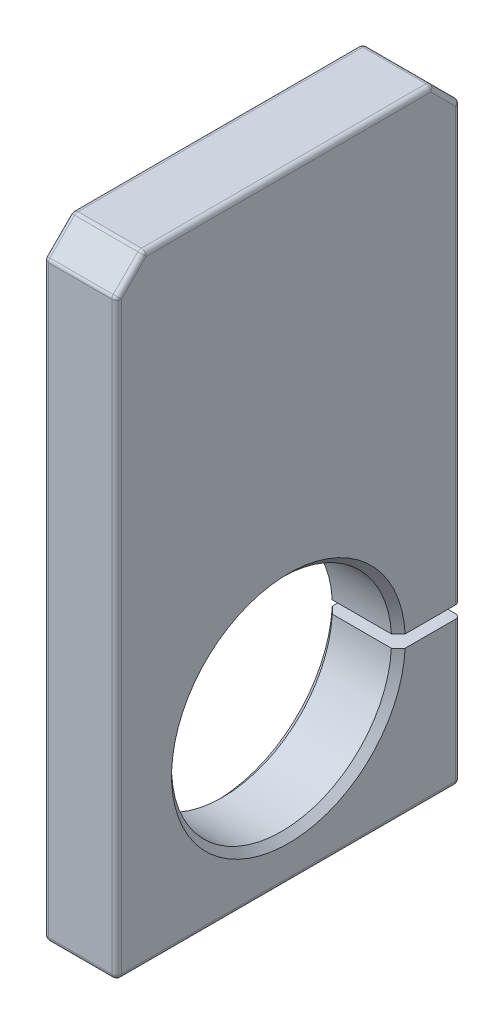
ISO-10303-21;
HEADER;
FILE_DESCRIPTION(('STEP AP214'),'2;1');
FILE_NAME('part.step','',(''),(''),'','','');
FILE_SCHEMA(('AUTOMOTIVE_DESIGN { 1 0 10303 214 1 1 1 1 }'));
ENDSEC;
DATA;
#1=APPLICATION_CONTEXT('core data for automotive mechanical design processes');
#2=APPLICATION_PROTOCOL_DEFINITION('international standard','automotive_design',2000,#1);
#3=PRODUCT_CONTEXT('',#1,'mechanical');
#4=PRODUCT('Part','Part','',(#3));
#5=PRODUCT_RELATED_PRODUCT_CATEGORY('part','',(#4));
#6=PRODUCT_DEFINITION_FORMATION('','',#4);
#7=PRODUCT_DEFINITION_CONTEXT('part definition',#1,'design');
#8=PRODUCT_DEFINITION('design','',#6,#7);
#9=PRODUCT_DEFINITION_SHAPE('','',#8);
#10=(LENGTH_UNIT() NAMED_UNIT(*) SI_UNIT(.MILLI.,.METRE.));
#11=(NAMED_UNIT(*) PLANE_ANGLE_UNIT() SI_UNIT($,.RADIAN.));
#12=(NAMED_UNIT(*) SI_UNIT($,.STERADIAN.) SOLID_ANGLE_UNIT());
#13=UNCERTAINTY_MEASURE_WITH_UNIT(LENGTH_MEASURE(1.E-05),#10,'distance_accuracy_value','');
#14=(GEOMETRIC_REPRESENTATION_CONTEXT(3) GLOBAL_UNCERTAINTY_ASSIGNED_CONTEXT((#13)) GLOBAL_UNIT_ASSIGNED_CONTEXT((#10,
#11,#12)) REPRESENTATION_CONTEXT('',''));
#15=CARTESIAN_POINT('',(0.,0.,0.));
#16=DIRECTION('',(0.,0.,1.));
#17=DIRECTION('',(1.,0.,0.));
#18=AXIS2_PLACEMENT_3D('',#15,#16,#17);
#19=CARTESIAN_POINT('',(-2.65,34.,12.5));
#20=DIRECTION('',(0.,0.,1.));
#21=DIRECTION('',(0.,-1.,0.));
#22=AXIS2_PLACEMENT_3D('',#19,#20,#21);
#23=PLANE('',#22);
#24=DIRECTION('',(0.,-1.,0.));
#25=VECTOR('',#24,1.);
#26=CARTESIAN_POINT('',(2.3,34.,12.5));
#27=LINE('',#26,#25);
#28=CARTESIAN_POINT('',(2.3,-10.65,12.5));
#29=VERTEX_POINT('',#28);
#30=CARTESIAN_POINT('',(2.3,31.8550252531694,12.5));
#31=VERTEX_POINT('',#30);
#32=EDGE_CURVE('E522',#29,#31,#27,.F.);
#33=ORIENTED_EDGE('',*,*,#32,.T.);
#34=DIRECTION('',(1.,0.,0.));
#35=VECTOR('',#34,1.);
#36=CARTESIAN_POINT('',(-2.65,31.8550252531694,12.5));
#37=LINE('',#36,#35);
#38=CARTESIAN_POINT('',(-2.3,31.8550252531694,12.5));
#39=VERTEX_POINT('',#38);
#40=EDGE_CURVE('E517',#31,#39,#37,.F.);
#41=ORIENTED_EDGE('',*,*,#40,.T.);
#42=DIRECTION('',(0.,-1.,0.));
#43=VECTOR('',#42,1.);
#44=CARTESIAN_POINT('',(-2.3,-11.,12.5));
#45=LINE('',#44,#43);
#46=CARTESIAN_POINT('',(-2.3,-10.65,12.5));
#47=VERTEX_POINT('',#46);
#48=EDGE_CURVE('E519',#39,#47,#45,.T.);
#49=ORIENTED_EDGE('',*,*,#48,.T.);
#50=DIRECTION('',(1.,0.,0.));
#51=VECTOR('',#50,1.);
#52=CARTESIAN_POINT('',(-2.65,-10.65,12.5));
#53=LINE('',#52,#51);
#54=EDGE_CURVE('E524',#47,#29,#53,.T.);
#55=ORIENTED_EDGE('',*,*,#54,.T.);
#56=EDGE_LOOP('',(#33,#41,#49,#55));
#57=FACE_BOUND('',#56,.T.);
#58=ADVANCED_FACE('F33',(#57),#23,.T.);
#59=CARTESIAN_POINT('',(-2.65,34.,12.5));
#60=DIRECTION('',(0.,1.,0.));
#61=DIRECTION('',(0.,0.,1.));
#62=AXIS2_PLACEMENT_3D('',#59,#60,#61);
#63=PLANE('',#62);
#64=DIRECTION('',(-1.,0.,0.));
#65=VECTOR('',#64,1.);
#66=CARTESIAN_POINT('',(-2.65,34.,10.3550252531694));
#67=LINE('',#66,#65);
#68=CARTESIAN_POINT('',(-2.3,34.,10.3550252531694));
#69=VERTEX_POINT('',#68);
#70=CARTESIAN_POINT('',(2.3,34.,10.3550252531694));
#71=VERTEX_POINT('',#70);
#72=EDGE_CURVE('E476',#69,#71,#67,.F.);
#73=ORIENTED_EDGE('',*,*,#72,.T.);
#74=DIRECTION('',(0.,0.,1.));
#75=VECTOR('',#74,1.);
#76=CARTESIAN_POINT('',(2.3,34.,12.5));
#77=LINE('',#76,#75);
#78=CARTESIAN_POINT('',(2.3,34.,-10.3550252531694));
#79=VERTEX_POINT('',#78);
#80=EDGE_CURVE('E473',#71,#79,#77,.F.);
#81=ORIENTED_EDGE('',*,*,#80,.T.);
#82=DIRECTION('',(1.,0.,0.));
#83=VECTOR('',#82,1.);
#84=CARTESIAN_POINT('',(-2.65,34.,-10.3550252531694));
#85=LINE('',#84,#83);
#86=CARTESIAN_POINT('',(-2.3,34.,-10.3550252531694));
#87=VERTEX_POINT('',#86);
#88=EDGE_CURVE('E480',#79,#87,#85,.F.);
#89=ORIENTED_EDGE('',*,*,#88,.T.);
#90=DIRECTION('',(0.,0.,1.));
#91=VECTOR('',#90,1.);
#92=CARTESIAN_POINT('',(-2.3,34.,10.5));
#93=LINE('',#92,#91);
#94=EDGE_CURVE('E478',#87,#69,#93,.T.);
#95=ORIENTED_EDGE('',*,*,#94,.T.);
#96=EDGE_LOOP('',(#73,#81,#89,#95));
#97=FACE_BOUND('',#96,.T.);
#98=ADVANCED_FACE('F295',(#97),#63,.T.);
#99=CARTESIAN_POINT('',(-2.65,34.,-12.5));
#100=DIRECTION('',(0.,0.,-1.));
#101=DIRECTION('',(0.,1.,0.));
#102=AXIS2_PLACEMENT_3D('',#99,#100,#101);
#103=PLANE('',#102);
#104=DIRECTION('',(-1.,0.,0.));
#105=VECTOR('',#104,1.);
#106=CARTESIAN_POINT('',(-2.65,31.8550252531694,-12.5));
#107=LINE('',#106,#105);
#108=CARTESIAN_POINT('',(-2.3,31.8550252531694,-12.5));
#109=VERTEX_POINT('',#108);
#110=CARTESIAN_POINT('',(2.3,31.8550252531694,-12.5));
#111=VERTEX_POINT('',#110);
#112=EDGE_CURVE('E467',#109,#111,#107,.F.);
#113=ORIENTED_EDGE('',*,*,#112,.T.);
#114=DIRECTION('',(0.,1.,0.));
#115=VECTOR('',#114,1.);
#116=CARTESIAN_POINT('',(2.3,34.,-12.5));
#117=LINE('',#116,#115);
#118=CARTESIAN_POINT('',(2.3,0.45,-12.5));
#119=VERTEX_POINT('',#118);
#120=EDGE_CURVE('E465',#111,#119,#117,.F.);
#121=ORIENTED_EDGE('',*,*,#120,.T.);
#122=DIRECTION('',(1.,0.,0.));
#123=VECTOR('',#122,1.);
#124=CARTESIAN_POINT('',(-2.65,0.45,-12.5));
#125=LINE('',#124,#123);
#126=CARTESIAN_POINT('',(-2.3,0.45,-12.5));
#127=VERTEX_POINT('',#126);
#128=EDGE_CURVE('E234',#127,#119,#125,.T.);
#129=ORIENTED_EDGE('',*,*,#128,.F.);
#130=DIRECTION('',(0.,1.,0.));
#131=VECTOR('',#130,1.);
#132=CARTESIAN_POINT('',(-2.3,32.,-12.5));
#133=LINE('',#132,#131);
#134=EDGE_CURVE('E471',#127,#109,#133,.T.);
#135=ORIENTED_EDGE('',*,*,#134,.T.);
#136=EDGE_LOOP('',(#113,#121,#129,#135));
#137=FACE_BOUND('',#136,.T.);
#138=ADVANCED_FACE('F569',(#137),#103,.T.);
#139=CARTESIAN_POINT('',(-2.65,0.45,-7.98733372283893));
#140=DIRECTION('',(0.,-1.,0.));
#141=DIRECTION('',(0.,0.,-1.));
#142=AXIS2_PLACEMENT_3D('',#139,#140,#141);
#143=PLANE('',#142);
#144=CARTESIAN_POINT('',(0.,0.45,-10.2436668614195));
#145=DIRECTION('',(0.,-1.,0.));
#146=DIRECTION('',(0.,0.,-1.));
#147=AXIS2_PLACEMENT_3D('',#144,#145,#146);
#148=CIRCLE('',#147,0.875);
#149=CARTESIAN_POINT('',(0.,0.45,-11.1186668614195));
#150=VERTEX_POINT('',#149);
#151=EDGE_CURVE('E552',#150,#150,#148,.T.);
#152=ORIENTED_EDGE('',*,*,#151,.F.);
#153=EDGE_LOOP('',(#152));
#154=FACE_BOUND('',#153,.T.);
#155=ORIENTED_EDGE('',*,*,#128,.T.);
#156=CARTESIAN_POINT('',(2.3,0.45,-12.15));
#157=DIRECTION('',(0.,-1.,0.));
#158=DIRECTION('',(0.,0.,-1.));
#159=AXIS2_PLACEMENT_3D('',#156,#157,#158);
#160=CIRCLE('',#159,0.35);
#161=CARTESIAN_POINT('',(2.65,0.45,-12.15));
#162=VERTEX_POINT('',#161);
#163=EDGE_CURVE('E356',#119,#162,#160,.T.);
#164=ORIENTED_EDGE('',*,*,#163,.T.);
#165=DIRECTION('',(0.,0.,-1.));
#166=VECTOR('',#165,1.);
#167=CARTESIAN_POINT('',(2.65,0.45,-7.98733372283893));
#168=LINE('',#167,#166);
#169=CARTESIAN_POINT('',(2.65,0.45,-8.48807987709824));
#170=VERTEX_POINT('',#169);
#171=EDGE_CURVE('E218',#170,#162,#168,.T.);
#172=ORIENTED_EDGE('',*,*,#171,.F.);
#173=CARTESIAN_POINT('',(2.65,0.45,-8.48807987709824));
#174=CARTESIAN_POINT('',(2.56666288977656,0.45,-8.40462595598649));
#175=CARTESIAN_POINT('',(2.48332766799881,0.45,-8.321170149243));
#176=CARTESIAN_POINT('',(2.31666100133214,0.45,-8.1542547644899));
#177=CARTESIAN_POINT('',(2.23332955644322,0.45,-8.07079518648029));
#178=CARTESIAN_POINT('',(2.15,0.45,-7.98733372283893));
#179=B_SPLINE_CURVE_WITH_KNOTS('',3,(#173,#174,#175,#176,#177,#178),.UNSPECIFIED.,.F.,.F.,(4,2,
4),(0.,0.353817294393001,0.707634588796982),.UNSPECIFIED.);
#180=CARTESIAN_POINT('',(2.15,0.45,-7.98733372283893));
#181=VERTEX_POINT('',#180);
#182=EDGE_CURVE('E232',#170,#181,#179,.T.);
#183=ORIENTED_EDGE('',*,*,#182,.T.);
#184=DIRECTION('',(1.,0.,0.));
#185=VECTOR('',#184,1.);
#186=CARTESIAN_POINT('',(-2.65,0.45,-7.98733372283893));
#187=LINE('',#186,#185);
#188=CARTESIAN_POINT('',(-2.15,0.45,-7.98733372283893));
#189=VERTEX_POINT('',#188);
#190=EDGE_CURVE('E238',#189,#181,#187,.T.);
#191=ORIENTED_EDGE('',*,*,#190,.F.);
#192=CARTESIAN_POINT('',(-2.15,0.45,-7.98733372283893));
#193=CARTESIAN_POINT('',(-2.23332955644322,0.45,-8.07079518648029));
#194=CARTESIAN_POINT('',(-2.31666100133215,0.45,-8.1542547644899));
#195=CARTESIAN_POINT('',(-2.48332766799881,0.45,-8.321170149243));
#196=CARTESIAN_POINT('',(-2.56666288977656,0.45,-8.4046259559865));
#197=CARTESIAN_POINT('',(-2.65,0.45,-8.48807987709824));
#198=B_SPLINE_CURVE_WITH_KNOTS('',3,(#192,#193,#194,#195,#196,#197),.UNSPECIFIED.,.F.,.F.,(4,2,
4),(0.,0.353817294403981,0.707634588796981),.UNSPECIFIED.);
#199=CARTESIAN_POINT('',(-2.65,0.45,-8.48807987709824));
#200=VERTEX_POINT('',#199);
#201=EDGE_CURVE('E233',#189,#200,#198,.T.);
#202=ORIENTED_EDGE('',*,*,#201,.T.);
#203=DIRECTION('',(0.,0.,-1.));
#204=VECTOR('',#203,1.);
#205=CARTESIAN_POINT('',(-2.65,0.45,-7.98733372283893));
#206=LINE('',#205,#204);
#207=CARTESIAN_POINT('',(-2.65,0.45,-12.15));
#208=VERTEX_POINT('',#207);
#209=EDGE_CURVE('E534',#200,#208,#206,.T.);
#210=ORIENTED_EDGE('',*,*,#209,.T.);
#211=CARTESIAN_POINT('',(-2.3,0.449999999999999,-12.15));
#212=DIRECTION('',(0.,-1.,0.));
#213=DIRECTION('',(0.,0.,-1.));
#214=AXIS2_PLACEMENT_3D('',#211,#212,#213);
#215=CIRCLE('',#214,0.35);
#216=EDGE_CURVE('E354',#208,#127,#215,.T.);
#217=ORIENTED_EDGE('',*,*,#216,.T.);
#218=EDGE_LOOP('',(#155,#164,#172,#183,#191,#202,#210,#217));
#219=FACE_BOUND('',#218,.T.);
#220=ADVANCED_FACE('F254',(#154,#219),#143,.T.);
#221=CARTESIAN_POINT('',(-2.65,0.,0.));
#222=DIRECTION('',(1.,0.,0.));
#223=DIRECTION('',(0.,0.,-1.));
#224=AXIS2_PLACEMENT_3D('',#221,#222,#223);
#225=CYLINDRICAL_SURFACE('',#224,8.);
#226=ORIENTED_EDGE('',*,*,#190,.T.);
#227=CARTESIAN_POINT('',(2.15,0.,0.));
#228=DIRECTION('',(1.,0.,0.));
#229=DIRECTION('',(0.,0.,-1.));
#230=AXIS2_PLACEMENT_3D('',#227,#228,#229);
#231=CIRCLE('',#230,8.);
#232=CARTESIAN_POINT('',(2.15,-0.449999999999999,-7.98733372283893));
#233=VERTEX_POINT('',#232);
#234=EDGE_CURVE('E274',#181,#233,#231,.T.);
#235=ORIENTED_EDGE('',*,*,#234,.T.);
#236=DIRECTION('',(1.,0.,0.));
#237=VECTOR('',#236,1.);
#238=CARTESIAN_POINT('',(-2.65,-0.449999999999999,-7.98733372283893));
#239=LINE('',#238,#237);
#240=CARTESIAN_POINT('',(-2.15,-0.449999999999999,-7.98733372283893));
#241=VERTEX_POINT('',#240);
#242=EDGE_CURVE('E225',#241,#233,#239,.T.);
#243=ORIENTED_EDGE('',*,*,#242,.F.);
#244=CARTESIAN_POINT('',(-2.15,0.,0.));
#245=DIRECTION('',(1.,0.,0.));
#246=DIRECTION('',(0.,0.,-1.));
#247=AXIS2_PLACEMENT_3D('',#244,#245,#246);
#248=CIRCLE('',#247,8.);
#249=EDGE_CURVE('E537',#241,#189,#248,.F.);
#250=ORIENTED_EDGE('',*,*,#249,.T.);
#251=EDGE_LOOP('',(#226,#235,#243,#250));
#252=FACE_BOUND('',#251,.T.);
#253=ADVANCED_FACE('F283',(#252),#225,.F.);
#254=CARTESIAN_POINT('',(-2.65,-0.45,-7.98733372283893));
#255=DIRECTION('',(0.,1.,0.));
#256=DIRECTION('',(0.,0.,1.));
#257=AXIS2_PLACEMENT_3D('',#254,#255,#256);
#258=PLANE('',#257);
#259=CARTESIAN_POINT('',(0.,-0.45,-10.2436668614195));
#260=DIRECTION('',(0.,1.,0.));
#261=DIRECTION('',(0.,0.,1.));
#262=AXIS2_PLACEMENT_3D('',#259,#260,#261);
#263=CIRCLE('',#262,1.25);
#264=CARTESIAN_POINT('',(0.,-0.45,-11.4936668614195));
#265=VERTEX_POINT('',#264);
#266=EDGE_CURVE('E362',#265,#265,#263,.F.);
#267=ORIENTED_EDGE('',*,*,#266,.T.);
#268=EDGE_LOOP('',(#267));
#269=FACE_BOUND('',#268,.T.);
#270=DIRECTION('',(0.,0.,1.));
#271=VECTOR('',#270,1.);
#272=CARTESIAN_POINT('',(2.65,-0.45,-7.98733372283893));
#273=LINE('',#272,#271);
#274=CARTESIAN_POINT('',(2.65,-0.45,-12.15));
#275=VERTEX_POINT('',#274);
#276=CARTESIAN_POINT('',(2.65,-0.45,-8.48807987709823));
#277=VERTEX_POINT('',#276);
#278=EDGE_CURVE('E207',#275,#277,#273,.T.);
#279=ORIENTED_EDGE('',*,*,#278,.F.);
#280=CARTESIAN_POINT('',(2.3,-0.45,-12.15));
#281=DIRECTION('',(0.,1.,0.));
#282=DIRECTION('',(0.,0.,1.));
#283=AXIS2_PLACEMENT_3D('',#280,#281,#282);
#284=CIRCLE('',#283,0.35);
#285=CARTESIAN_POINT('',(2.3,-0.45,-12.5));
#286=VERTEX_POINT('',#285);
#287=EDGE_CURVE('E11',#275,#286,#284,.T.);
#288=ORIENTED_EDGE('',*,*,#287,.T.);
#289=DIRECTION('',(1.,0.,0.));
#290=VECTOR('',#289,1.);
#291=CARTESIAN_POINT('',(-2.65,-0.45,-12.5));
#292=LINE('',#291,#290);
#293=CARTESIAN_POINT('',(-2.3,-0.45,-12.5));
#294=VERTEX_POINT('',#293);
#295=EDGE_CURVE('E241',#294,#286,#292,.T.);
#296=ORIENTED_EDGE('',*,*,#295,.F.);
#297=CARTESIAN_POINT('',(-2.3,-0.45,-12.15));
#298=DIRECTION('',(0.,1.,0.));
#299=DIRECTION('',(0.,0.,1.));
#300=AXIS2_PLACEMENT_3D('',#297,#298,#299);
#301=CIRCLE('',#300,0.35);
#302=CARTESIAN_POINT('',(-2.65,-0.45,-12.15));
#303=VERTEX_POINT('',#302);
#304=EDGE_CURVE('E42',#294,#303,#301,.T.);
#305=ORIENTED_EDGE('',*,*,#304,.T.);
#306=DIRECTION('',(0.,0.,1.));
#307=VECTOR('',#306,1.);
#308=CARTESIAN_POINT('',(-2.65,-0.45,-7.98733372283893));
#309=LINE('',#308,#307);
#310=CARTESIAN_POINT('',(-2.65,-0.45,-8.48807987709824));
#311=VERTEX_POINT('',#310);
#312=EDGE_CURVE('E531',#303,#311,#309,.T.);
#313=ORIENTED_EDGE('',*,*,#312,.T.);
#314=CARTESIAN_POINT('',(-2.65,-0.45,-8.48807987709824));
#315=CARTESIAN_POINT('',(-2.56666288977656,-0.45,-8.4046259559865));
#316=CARTESIAN_POINT('',(-2.48332766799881,-0.45,-8.321170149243));
#317=CARTESIAN_POINT('',(-2.31666100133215,-0.45,-8.1542547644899));
#318=CARTESIAN_POINT('',(-2.23332955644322,-0.45,-8.07079518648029));
#319=CARTESIAN_POINT('',(-2.15,-0.45,-7.98733372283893));
#320=B_SPLINE_CURVE_WITH_KNOTS('',3,(#314,#315,#316,#317,#318,#319),.UNSPECIFIED.,.F.,.F.,(4,2,
4),(0.,0.353817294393,0.707634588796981),.UNSPECIFIED.);
#321=EDGE_CURVE('E229',#311,#241,#320,.T.);
#322=ORIENTED_EDGE('',*,*,#321,.T.);
#323=ORIENTED_EDGE('',*,*,#242,.T.);
#324=CARTESIAN_POINT('',(2.15,-0.449999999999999,-7.98733372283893));
#325=CARTESIAN_POINT('',(2.23332955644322,-0.45,-8.07079518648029));
#326=CARTESIAN_POINT('',(2.31666100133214,-0.45,-8.1542547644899));
#327=CARTESIAN_POINT('',(2.48332766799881,-0.45,-8.321170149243));
#328=CARTESIAN_POINT('',(2.56666288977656,-0.45,-8.40462595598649));
#329=CARTESIAN_POINT('',(2.65,-0.45,-8.48807987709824));
#330=B_SPLINE_CURVE_WITH_KNOTS('',3,(#324,#325,#326,#327,#328,#329),.UNSPECIFIED.,.F.,.F.,(4,2,
4),(0.,0.353817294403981,0.707634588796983),.UNSPECIFIED.);
#331=EDGE_CURVE('E222',#233,#277,#330,.T.);
#332=ORIENTED_EDGE('',*,*,#331,.T.);
#333=EDGE_LOOP('',(#279,#288,#296,#305,#313,#322,#323,#332));
#334=FACE_BOUND('',#333,.T.);
#335=ADVANCED_FACE('F223',(#269,#334),#258,.T.);
#336=CARTESIAN_POINT('',(-2.65,-0.45,-12.5));
#337=DIRECTION('',(0.,0.,-1.));
#338=DIRECTION('',(-1.,0.,0.));
#339=AXIS2_PLACEMENT_3D('',#336,#337,#338);
#340=PLANE('',#339);
#341=ORIENTED_EDGE('',*,*,#295,.T.);
#342=DIRECTION('',(0.,1.,0.));
#343=VECTOR('',#342,1.);
#344=CARTESIAN_POINT('',(2.3,-0.45,-12.5));
#345=LINE('',#344,#343);
#346=CARTESIAN_POINT('',(2.3,-10.65,-12.5));
#347=VERTEX_POINT('',#346);
#348=EDGE_CURVE('E50',#286,#347,#345,.F.);
#349=ORIENTED_EDGE('',*,*,#348,.T.);
#350=DIRECTION('',(1.,0.,0.));
#351=VECTOR('',#350,1.);
#352=CARTESIAN_POINT('',(-2.65,-10.65,-12.5));
#353=LINE('',#352,#351);
#354=CARTESIAN_POINT('',(-2.3,-10.65,-12.5));
#355=VERTEX_POINT('',#354);
#356=EDGE_CURVE('E55',#347,#355,#353,.F.);
#357=ORIENTED_EDGE('',*,*,#356,.T.);
#358=DIRECTION('',(0.,1.,0.));
#359=VECTOR('',#358,1.);
#360=CARTESIAN_POINT('',(-2.3,-0.45,-12.5));
#361=LINE('',#360,#359);
#362=EDGE_CURVE('E350',#355,#294,#361,.T.);
#363=ORIENTED_EDGE('',*,*,#362,.T.);
#364=EDGE_LOOP('',(#341,#349,#357,#363));
#365=FACE_BOUND('',#364,.T.);
#366=ADVANCED_FACE('F282',(#365),#340,.T.);
#367=CARTESIAN_POINT('',(-2.65,-11.,12.5));
#368=DIRECTION('',(0.,-1.,0.));
#369=DIRECTION('',(0.,0.,-1.));
#370=AXIS2_PLACEMENT_3D('',#367,#368,#369);
#371=PLANE('',#370);
#372=CARTESIAN_POINT('',(0.,-11.,-10.2436668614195));
#373=DIRECTION('',(0.,-1.,0.));
#374=DIRECTION('',(0.,0.,-1.));
#375=AXIS2_PLACEMENT_3D('',#372,#373,#374);
#376=CIRCLE('',#375,1.25);
#377=CARTESIAN_POINT('',(0.,-11.,-11.4936668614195));
#378=VERTEX_POINT('',#377);
#379=EDGE_CURVE('E548',#378,#378,#376,.T.);
#380=ORIENTED_EDGE('',*,*,#379,.F.);
#381=EDGE_LOOP('',(#380));
#382=FACE_BOUND('',#381,.T.);
#383=DIRECTION('',(0.,0.,-1.));
#384=VECTOR('',#383,1.);
#385=CARTESIAN_POINT('',(-2.3,-11.,-12.5));
#386=LINE('',#385,#384);
#387=CARTESIAN_POINT('',(-2.3,-11.,12.15));
#388=VERTEX_POINT('',#387);
#389=CARTESIAN_POINT('',(-2.3,-11.,-12.15));
#390=VERTEX_POINT('',#389);
#391=EDGE_CURVE('E345',#388,#390,#386,.T.);
#392=ORIENTED_EDGE('',*,*,#391,.T.);
#393=DIRECTION('',(1.,0.,0.));
#394=VECTOR('',#393,1.);
#395=CARTESIAN_POINT('',(-2.65,-11.,-12.15));
#396=LINE('',#395,#394);
#397=CARTESIAN_POINT('',(2.3,-11.,-12.15));
#398=VERTEX_POINT('',#397);
#399=EDGE_CURVE('E347',#390,#398,#396,.T.);
#400=ORIENTED_EDGE('',*,*,#399,.T.);
#401=DIRECTION('',(0.,0.,-1.));
#402=VECTOR('',#401,1.);
#403=CARTESIAN_POINT('',(2.3,-11.,12.5));
#404=LINE('',#403,#402);
#405=CARTESIAN_POINT('',(2.3,-11.,12.15));
#406=VERTEX_POINT('',#405);
#407=EDGE_CURVE('E338',#398,#406,#404,.F.);
#408=ORIENTED_EDGE('',*,*,#407,.T.);
#409=DIRECTION('',(1.,0.,0.));
#410=VECTOR('',#409,1.);
#411=CARTESIAN_POINT('',(-2.65,-11.,12.15));
#412=LINE('',#411,#410);
#413=EDGE_CURVE('E340',#406,#388,#412,.F.);
#414=ORIENTED_EDGE('',*,*,#413,.T.);
#415=EDGE_LOOP('',(#392,#400,#408,#414));
#416=FACE_BOUND('',#415,.T.);
#417=ADVANCED_FACE('F288',(#382,#416),#371,.T.);
#418=CARTESIAN_POINT('',(-2.65,0.,0.));
#419=DIRECTION('',(1.,0.,0.));
#420=DIRECTION('',(0.,0.,-1.));
#421=AXIS2_PLACEMENT_3D('',#418,#419,#420);
#422=PLANE('',#421);
#423=DIRECTION('',(0.,0.707106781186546,0.707106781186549));
#424=VECTOR('',#423,1.);
#425=CARTESIAN_POINT('',(-2.65,31.7525126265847,-12.2525126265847));
#426=LINE('',#425,#424);
#427=CARTESIAN_POINT('',(-2.65,33.65,-10.3550252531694));
#428=VERTEX_POINT('',#427);
#429=CARTESIAN_POINT('',(-2.65,31.8550252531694,-12.15));
#430=VERTEX_POINT('',#429);
#431=EDGE_CURVE('E463',#428,#430,#426,.F.);
#432=ORIENTED_EDGE('',*,*,#431,.T.);
#433=DIRECTION('',(0.,1.,0.));
#434=VECTOR('',#433,1.);
#435=CARTESIAN_POINT('',(-2.65,0.449999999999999,-12.15));
#436=LINE('',#435,#434);
#437=EDGE_CURVE('E503',#430,#208,#436,.F.);
#438=ORIENTED_EDGE('',*,*,#437,.T.);
#439=ORIENTED_EDGE('',*,*,#209,.F.);
#440=CARTESIAN_POINT('',(-2.65,0.,0.));
#441=DIRECTION('',(1.,0.,0.));
#442=DIRECTION('',(0.,0.,-1.));
#443=AXIS2_PLACEMENT_3D('',#440,#441,#442);
#444=CIRCLE('',#443,8.5);
#445=EDGE_CURVE('E228',#200,#311,#444,.T.);
#446=ORIENTED_EDGE('',*,*,#445,.T.);
#447=ORIENTED_EDGE('',*,*,#312,.F.);
#448=DIRECTION('',(0.,1.,0.));
#449=VECTOR('',#448,1.);
#450=CARTESIAN_POINT('',(-2.65,-11.,-12.15));
#451=LINE('',#450,#449);
#452=CARTESIAN_POINT('',(-2.65,-10.65,-12.15));
#453=VERTEX_POINT('',#452);
#454=EDGE_CURVE('E515',#303,#453,#451,.F.);
#455=ORIENTED_EDGE('',*,*,#454,.T.);
#456=DIRECTION('',(0.,0.,-1.));
#457=VECTOR('',#456,1.);
#458=CARTESIAN_POINT('',(-2.65,-10.65,12.5));
#459=LINE('',#458,#457);
#460=CARTESIAN_POINT('',(-2.65,-10.65,12.15));
#461=VERTEX_POINT('',#460);
#462=EDGE_CURVE('E513',#453,#461,#459,.F.);
#463=ORIENTED_EDGE('',*,*,#462,.T.);
#464=DIRECTION('',(0.,-1.,0.));
#465=VECTOR('',#464,1.);
#466=CARTESIAN_POINT('',(-2.65,32.,12.15));
#467=LINE('',#466,#465);
#468=CARTESIAN_POINT('',(-2.65,31.8550252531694,12.15));
#469=VERTEX_POINT('',#468);
#470=EDGE_CURVE('E510',#461,#469,#467,.F.);
#471=ORIENTED_EDGE('',*,*,#470,.T.);
#472=DIRECTION('',(0.,-0.707106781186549,0.707106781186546));
#473=VECTOR('',#472,1.);
#474=CARTESIAN_POINT('',(-2.65,33.7525126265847,10.2525126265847));
#475=LINE('',#474,#473);
#476=CARTESIAN_POINT('',(-2.65,33.65,10.3550252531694));
#477=VERTEX_POINT('',#476);
#478=EDGE_CURVE('E508',#469,#477,#475,.F.);
#479=ORIENTED_EDGE('',*,*,#478,.T.);
#480=DIRECTION('',(0.,0.,1.));
#481=VECTOR('',#480,1.);
#482=CARTESIAN_POINT('',(-2.65,33.65,-10.5));
#483=LINE('',#482,#481);
#484=EDGE_CURVE('E506',#477,#428,#483,.F.);
#485=ORIENTED_EDGE('',*,*,#484,.T.);
#486=EDGE_LOOP('',(#432,#438,#439,#446,#447,#455,#463,#471,#479,#485));
#487=FACE_BOUND('',#486,.T.);
#488=ADVANCED_FACE('F291',(#487),#422,.F.);
#489=CARTESIAN_POINT('',(2.65,0.,0.));
#490=DIRECTION('',(1.,0.,0.));
#491=DIRECTION('',(0.,0.,-1.));
#492=AXIS2_PLACEMENT_3D('',#489,#490,#491);
#493=PLANE('',#492);
#494=ORIENTED_EDGE('',*,*,#171,.T.);
#495=DIRECTION('',(0.,1.,0.));
#496=VECTOR('',#495,1.);
#497=CARTESIAN_POINT('',(2.65,0.,-12.15));
#498=LINE('',#497,#496);
#499=CARTESIAN_POINT('',(2.65,31.8550252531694,-12.15));
#500=VERTEX_POINT('',#499);
#501=EDGE_CURVE('E491',#162,#500,#498,.T.);
#502=ORIENTED_EDGE('',*,*,#501,.T.);
#503=DIRECTION('',(0.,-0.707106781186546,-0.707106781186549));
#504=VECTOR('',#503,1.);
#505=CARTESIAN_POINT('',(2.65,22.0025126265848,-22.0025126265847));
#506=LINE('',#505,#504);
#507=CARTESIAN_POINT('',(2.65,33.65,-10.3550252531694));
#508=VERTEX_POINT('',#507);
#509=EDGE_CURVE('E323',#500,#508,#506,.F.);
#510=ORIENTED_EDGE('',*,*,#509,.T.);
#511=DIRECTION('',(0.,0.,1.));
#512=VECTOR('',#511,1.);
#513=CARTESIAN_POINT('',(2.65,33.65,0.));
#514=LINE('',#513,#512);
#515=CARTESIAN_POINT('',(2.65,33.65,10.3550252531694));
#516=VERTEX_POINT('',#515);
#517=EDGE_CURVE('E494',#508,#516,#514,.T.);
#518=ORIENTED_EDGE('',*,*,#517,.T.);
#519=DIRECTION('',(0.,0.707106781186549,-0.707106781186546));
#520=VECTOR('',#519,1.);
#521=CARTESIAN_POINT('',(2.65,22.0025126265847,22.0025126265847));
#522=LINE('',#521,#520);
#523=CARTESIAN_POINT('',(2.65,31.8550252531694,12.15));
#524=VERTEX_POINT('',#523);
#525=EDGE_CURVE('E496',#516,#524,#522,.F.);
#526=ORIENTED_EDGE('',*,*,#525,.T.);
#527=DIRECTION('',(0.,-1.,0.));
#528=VECTOR('',#527,1.);
#529=CARTESIAN_POINT('',(2.65,0.,12.15));
#530=LINE('',#529,#528);
#531=CARTESIAN_POINT('',(2.65,-10.65,12.15));
#532=VERTEX_POINT('',#531);
#533=EDGE_CURVE('E498',#524,#532,#530,.T.);
#534=ORIENTED_EDGE('',*,*,#533,.T.);
#535=DIRECTION('',(0.,0.,-1.));
#536=VECTOR('',#535,1.);
#537=CARTESIAN_POINT('',(2.65,-10.65,0.));
#538=LINE('',#537,#536);
#539=CARTESIAN_POINT('',(2.65,-10.65,-12.15));
#540=VERTEX_POINT('',#539);
#541=EDGE_CURVE('E500',#532,#540,#538,.T.);
#542=ORIENTED_EDGE('',*,*,#541,.T.);
#543=DIRECTION('',(0.,1.,0.));
#544=VECTOR('',#543,1.);
#545=CARTESIAN_POINT('',(2.65,0.,-12.15));
#546=LINE('',#545,#544);
#547=EDGE_CURVE('E215',#540,#275,#546,.T.);
#548=ORIENTED_EDGE('',*,*,#547,.T.);
#549=ORIENTED_EDGE('',*,*,#278,.T.);
#550=CARTESIAN_POINT('',(2.65,0.,0.));
#551=DIRECTION('',(1.,0.,0.));
#552=DIRECTION('',(0.,0.,-1.));
#553=AXIS2_PLACEMENT_3D('',#550,#551,#552);
#554=CIRCLE('',#553,8.5);
#555=EDGE_CURVE('E212',#277,#170,#554,.F.);
#556=ORIENTED_EDGE('',*,*,#555,.T.);
#557=EDGE_LOOP('',(#494,#502,#510,#518,#526,#534,#542,#548,#549,#556));
#558=FACE_BOUND('',#557,.T.);
#559=ADVANCED_FACE('F210',(#558),#493,.T.);
#560=CARTESIAN_POINT('',(-2.65,34.,10.5));
#561=DIRECTION('',(0.,-0.707106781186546,-0.707106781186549));
#562=DIRECTION('',(0.,0.707106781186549,-0.707106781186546));
#563=AXIS2_PLACEMENT_3D('',#560,#561,#562);
#564=PLANE('',#563);
#565=DIRECTION('',(-1.,0.,0.));
#566=VECTOR('',#565,1.);
#567=CARTESIAN_POINT('',(-2.65,32.1025126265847,12.3974873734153));
#568=LINE('',#567,#566);
#569=CARTESIAN_POINT('',(-2.3,32.1025126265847,12.3974873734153));
#570=VERTEX_POINT('',#569);
#571=CARTESIAN_POINT('',(2.3,32.1025126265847,12.3974873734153));
#572=VERTEX_POINT('',#571);
#573=EDGE_CURVE('E485',#570,#572,#568,.F.);
#574=ORIENTED_EDGE('',*,*,#573,.T.);
#575=DIRECTION('',(0.,-0.707106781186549,0.707106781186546));
#576=VECTOR('',#575,1.);
#577=CARTESIAN_POINT('',(2.3,34.,10.5));
#578=LINE('',#577,#576);
#579=CARTESIAN_POINT('',(2.3,33.8974873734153,10.6025126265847));
#580=VERTEX_POINT('',#579);
#581=EDGE_CURVE('E482',#572,#580,#578,.F.);
#582=ORIENTED_EDGE('',*,*,#581,.T.);
#583=DIRECTION('',(1.,0.,0.));
#584=VECTOR('',#583,1.);
#585=CARTESIAN_POINT('',(-2.65,33.8974873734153,10.6025126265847));
#586=LINE('',#585,#584);
#587=CARTESIAN_POINT('',(-2.3,33.8974873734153,10.6025126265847));
#588=VERTEX_POINT('',#587);
#589=EDGE_CURVE('E489',#580,#588,#586,.F.);
#590=ORIENTED_EDGE('',*,*,#589,.T.);
#591=DIRECTION('',(0.,0.707106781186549,-0.707106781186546));
#592=VECTOR('',#591,1.);
#593=CARTESIAN_POINT('',(-2.3,32.,12.5));
#594=LINE('',#593,#592);
#595=EDGE_CURVE('E487',#588,#570,#594,.F.);
#596=ORIENTED_EDGE('',*,*,#595,.T.);
#597=EDGE_LOOP('',(#574,#582,#590,#596));
#598=FACE_BOUND('',#597,.T.);
#599=ADVANCED_FACE('F297',(#598),#564,.F.);
#600=CARTESIAN_POINT('',(-2.65,32.,-12.5));
#601=DIRECTION('',(0.,-0.707106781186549,0.707106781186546));
#602=DIRECTION('',(0.,-0.707106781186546,-0.707106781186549));
#603=AXIS2_PLACEMENT_3D('',#600,#601,#602);
#604=PLANE('',#603);
#605=DIRECTION('',(0.,0.707106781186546,0.707106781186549));
#606=VECTOR('',#605,1.);
#607=CARTESIAN_POINT('',(2.3,32.,-12.5));
#608=LINE('',#607,#606);
#609=CARTESIAN_POINT('',(2.3,33.8974873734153,-10.6025126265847));
#610=VERTEX_POINT('',#609);
#611=CARTESIAN_POINT('',(2.3,32.1025126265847,-12.3974873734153));
#612=VERTEX_POINT('',#611);
#613=EDGE_CURVE('E308',#610,#612,#608,.F.);
#614=ORIENTED_EDGE('',*,*,#613,.T.);
#615=DIRECTION('',(1.,0.,0.));
#616=VECTOR('',#615,1.);
#617=CARTESIAN_POINT('',(-2.65,32.1025126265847,-12.3974873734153));
#618=LINE('',#617,#616);
#619=CARTESIAN_POINT('',(-2.3,32.1025126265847,-12.3974873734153));
#620=VERTEX_POINT('',#619);
#621=EDGE_CURVE('E311',#612,#620,#618,.F.);
#622=ORIENTED_EDGE('',*,*,#621,.T.);
#623=DIRECTION('',(0.,-0.707106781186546,-0.707106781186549));
#624=VECTOR('',#623,1.);
#625=CARTESIAN_POINT('',(-2.3,34.,-10.5));
#626=LINE('',#625,#624);
#627=CARTESIAN_POINT('',(-2.3,33.8974873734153,-10.6025126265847));
#628=VERTEX_POINT('',#627);
#629=EDGE_CURVE('E464',#620,#628,#626,.F.);
#630=ORIENTED_EDGE('',*,*,#629,.T.);
#631=DIRECTION('',(-1.,0.,0.));
#632=VECTOR('',#631,1.);
#633=CARTESIAN_POINT('',(-2.65,33.8974873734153,-10.6025126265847));
#634=LINE('',#633,#632);
#635=EDGE_CURVE('E313',#628,#610,#634,.F.);
#636=ORIENTED_EDGE('',*,*,#635,.T.);
#637=EDGE_LOOP('',(#614,#622,#630,#636));
#638=FACE_BOUND('',#637,.T.);
#639=ADVANCED_FACE('F299',(#638),#604,.F.);
#640=CARTESIAN_POINT('',(2.65,0.,0.));
#641=DIRECTION('',(1.,0.,0.));
#642=DIRECTION('',(0.,0.,-1.));
#643=AXIS2_PLACEMENT_3D('',#640,#641,#642);
#644=CONICAL_SURFACE('',#643,8.5,0.785398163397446);
#645=ORIENTED_EDGE('',*,*,#331,.F.);
#646=ORIENTED_EDGE('',*,*,#234,.F.);
#647=ORIENTED_EDGE('',*,*,#182,.F.);
#648=ORIENTED_EDGE('',*,*,#555,.F.);
#649=EDGE_LOOP('',(#645,#646,#647,#648));
#650=FACE_BOUND('',#649,.T.);
#651=ADVANCED_FACE('F231',(#650),#644,.F.);
#652=CARTESIAN_POINT('',(-2.15,0.,0.));
#653=DIRECTION('',(-1.,0.,0.));
#654=DIRECTION('',(0.,0.,1.));
#655=AXIS2_PLACEMENT_3D('',#652,#653,#654);
#656=CONICAL_SURFACE('',#655,8.,0.785398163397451);
#657=ORIENTED_EDGE('',*,*,#321,.F.);
#658=ORIENTED_EDGE('',*,*,#445,.F.);
#659=ORIENTED_EDGE('',*,*,#201,.F.);
#660=ORIENTED_EDGE('',*,*,#249,.F.);
#661=EDGE_LOOP('',(#657,#658,#659,#660));
#662=FACE_BOUND('',#661,.T.);
#663=ADVANCED_FACE('F258',(#662),#656,.F.);
#664=CARTESIAN_POINT('',(2.3,0.,-12.15));
#665=DIRECTION('',(0.,1.,0.));
#666=DIRECTION('',(0.,0.,1.));
#667=AXIS2_PLACEMENT_3D('',#664,#665,#666);
#668=CYLINDRICAL_SURFACE('',#667,0.35);
#669=CARTESIAN_POINT('',(2.3,31.8550252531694,-12.15));
#670=DIRECTION('',(0.,1.,0.));
#671=DIRECTION('',(0.,0.,1.));
#672=AXIS2_PLACEMENT_3D('',#669,#670,#671);
#673=CIRCLE('',#672,0.35);
#674=EDGE_CURVE('E37',#500,#111,#673,.T.);
#675=ORIENTED_EDGE('',*,*,#674,.F.);
#676=ORIENTED_EDGE('',*,*,#501,.F.);
#677=ORIENTED_EDGE('',*,*,#163,.F.);
#678=ORIENTED_EDGE('',*,*,#120,.F.);
#679=EDGE_LOOP('',(#675,#676,#677,#678));
#680=FACE_BOUND('',#679,.T.);
#681=ADVANCED_FACE('F35',(#680),#668,.T.);
#682=CARTESIAN_POINT('',(2.3,31.8550252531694,-12.15));
#683=DIRECTION('',(0.,0.,1.));
#684=DIRECTION('',(1.,0.,0.));
#685=AXIS2_PLACEMENT_3D('',#682,#683,#684);
#686=SPHERICAL_SURFACE('',#685,0.35);
#687=CARTESIAN_POINT('',(2.3,31.8550252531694,-12.15));
#688=DIRECTION('',(0.,-0.70710678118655,-0.707106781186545));
#689=DIRECTION('',(0.,0.707106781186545,-0.70710678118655));
#690=AXIS2_PLACEMENT_3D('',#687,#688,#689);
#691=CIRCLE('',#690,0.35);
#692=EDGE_CURVE('E320',#500,#612,#691,.F.);
#693=ORIENTED_EDGE('',*,*,#692,.F.);
#694=ORIENTED_EDGE('',*,*,#674,.T.);
#695=CARTESIAN_POINT('',(2.3,31.8550252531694,-12.15));
#696=DIRECTION('',(1.,0.,0.));
#697=DIRECTION('',(0.,0.,-1.));
#698=AXIS2_PLACEMENT_3D('',#695,#696,#697);
#699=CIRCLE('',#698,0.35);
#700=EDGE_CURVE('E326',#612,#111,#699,.F.);
#701=ORIENTED_EDGE('',*,*,#700,.F.);
#702=EDGE_LOOP('',(#693,#694,#701));
#703=FACE_BOUND('',#702,.T.);
#704=ADVANCED_FACE('F330',(#703),#686,.T.);
#705=CARTESIAN_POINT('',(-2.3,34.,-12.15));
#706=DIRECTION('',(0.,-1.,0.));
#707=DIRECTION('',(0.,0.,-1.));
#708=AXIS2_PLACEMENT_3D('',#705,#706,#707);
#709=CYLINDRICAL_SURFACE('',#708,0.35);
#710=ORIENTED_EDGE('',*,*,#216,.F.);
#711=ORIENTED_EDGE('',*,*,#437,.F.);
#712=CARTESIAN_POINT('',(-2.3,31.8550252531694,-12.15));
#713=DIRECTION('',(0.,1.,0.));
#714=DIRECTION('',(-1.,0.,0.));
#715=AXIS2_PLACEMENT_3D('',#712,#713,#714);
#716=CIRCLE('',#715,0.35);
#717=EDGE_CURVE('E327',#109,#430,#716,.T.);
#718=ORIENTED_EDGE('',*,*,#717,.F.);
#719=ORIENTED_EDGE('',*,*,#134,.F.);
#720=EDGE_LOOP('',(#710,#711,#718,#719));
#721=FACE_BOUND('',#720,.T.);
#722=ADVANCED_FACE('F577',(#721),#709,.T.);
#723=CARTESIAN_POINT('',(-2.65,31.8550252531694,-12.15));
#724=DIRECTION('',(-1.,0.,0.));
#725=DIRECTION('',(0.,0.,1.));
#726=AXIS2_PLACEMENT_3D('',#723,#724,#725);
#727=CYLINDRICAL_SURFACE('',#726,0.35);
#728=ORIENTED_EDGE('',*,*,#700,.T.);
#729=ORIENTED_EDGE('',*,*,#112,.F.);
#730=CARTESIAN_POINT('',(-2.3,31.8550252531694,-12.15));
#731=DIRECTION('',(-1.,0.,0.));
#732=DIRECTION('',(0.,0.,1.));
#733=AXIS2_PLACEMENT_3D('',#730,#731,#732);
#734=CIRCLE('',#733,0.35);
#735=EDGE_CURVE('E337',#620,#109,#734,.T.);
#736=ORIENTED_EDGE('',*,*,#735,.F.);
#737=ORIENTED_EDGE('',*,*,#621,.F.);
#738=EDGE_LOOP('',(#728,#729,#736,#737));
#739=FACE_BOUND('',#738,.T.);
#740=ADVANCED_FACE('F335',(#739),#727,.T.);
#741=CARTESIAN_POINT('',(2.3,22.0025126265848,-22.0025126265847));
#742=DIRECTION('',(0.,-0.707106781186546,-0.707106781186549));
#743=DIRECTION('',(0.,0.707106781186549,-0.707106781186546));
#744=AXIS2_PLACEMENT_3D('',#741,#742,#743);
#745=CYLINDRICAL_SURFACE('',#744,0.35);
#746=ORIENTED_EDGE('',*,*,#692,.T.);
#747=ORIENTED_EDGE('',*,*,#613,.F.);
#748=CARTESIAN_POINT('',(2.3,33.65,-10.3550252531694));
#749=DIRECTION('',(0.,0.70710678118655,0.707106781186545));
#750=DIRECTION('',(0.,-0.707106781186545,0.70710678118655));
#751=AXIS2_PLACEMENT_3D('',#748,#749,#750);
#752=CIRCLE('',#751,0.35);
#753=EDGE_CURVE('E448',#508,#610,#752,.T.);
#754=ORIENTED_EDGE('',*,*,#753,.F.);
#755=ORIENTED_EDGE('',*,*,#509,.F.);
#756=EDGE_LOOP('',(#746,#747,#754,#755));
#757=FACE_BOUND('',#756,.T.);
#758=ADVANCED_FACE('F322',(#757),#745,.T.);
#759=CARTESIAN_POINT('',(-2.3,31.8550252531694,-12.15));
#760=DIRECTION('',(0.,0.,1.));
#761=DIRECTION('',(1.,0.,0.));
#762=AXIS2_PLACEMENT_3D('',#759,#760,#761);
#763=SPHERICAL_SURFACE('',#762,0.35);
#764=ORIENTED_EDGE('',*,*,#735,.T.);
#765=ORIENTED_EDGE('',*,*,#717,.T.);
#766=CARTESIAN_POINT('',(-2.3,31.8550252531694,-12.15));
#767=DIRECTION('',(0.,-0.707106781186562,-0.707106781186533));
#768=DIRECTION('',(0.,0.707106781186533,-0.707106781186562));
#769=AXIS2_PLACEMENT_3D('',#766,#767,#768);
#770=CIRCLE('',#769,0.35);
#771=EDGE_CURVE('E445',#620,#430,#770,.F.);
#772=ORIENTED_EDGE('',*,*,#771,.F.);
#773=EDGE_LOOP('',(#764,#765,#772));
#774=FACE_BOUND('',#773,.T.);
#775=ADVANCED_FACE('F455',(#774),#763,.T.);
#776=CARTESIAN_POINT('',(2.3,33.65,-10.3550252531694));
#777=DIRECTION('',(0.,0.,1.));
#778=DIRECTION('',(1.,0.,0.));
#779=AXIS2_PLACEMENT_3D('',#776,#777,#778);
#780=SPHERICAL_SURFACE('',#779,0.35);
#781=CARTESIAN_POINT('',(2.3,33.65,-10.3550252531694));
#782=DIRECTION('',(0.,0.,-1.));
#783=DIRECTION('',(-1.,0.,0.));
#784=AXIS2_PLACEMENT_3D('',#781,#782,#783);
#785=CIRCLE('',#784,0.35);
#786=EDGE_CURVE('E439',#508,#79,#785,.F.);
#787=ORIENTED_EDGE('',*,*,#786,.F.);
#788=ORIENTED_EDGE('',*,*,#753,.T.);
#789=CARTESIAN_POINT('',(2.3,33.65,-10.3550252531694));
#790=DIRECTION('',(1.,0.,0.));
#791=DIRECTION('',(0.,0.,-1.));
#792=AXIS2_PLACEMENT_3D('',#789,#790,#791);
#793=CIRCLE('',#792,0.35);
#794=EDGE_CURVE('E442',#79,#610,#793,.F.);
#795=ORIENTED_EDGE('',*,*,#794,.F.);
#796=EDGE_LOOP('',(#787,#788,#795));
#797=FACE_BOUND('',#796,.T.);
#798=ADVANCED_FACE('F801',(#797),#780,.T.);
#799=CARTESIAN_POINT('',(-2.3,22.0025126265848,-22.0025126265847));
#800=DIRECTION('',(0.,-0.707106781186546,-0.707106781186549));
#801=DIRECTION('',(0.,0.707106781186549,-0.707106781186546));
#802=AXIS2_PLACEMENT_3D('',#799,#800,#801);
#803=CYLINDRICAL_SURFACE('',#802,0.35);
#804=ORIENTED_EDGE('',*,*,#771,.T.);
#805=ORIENTED_EDGE('',*,*,#431,.F.);
#806=CARTESIAN_POINT('',(-2.3,33.65,-10.3550252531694));
#807=DIRECTION('',(0.,0.70710678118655,0.707106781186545));
#808=DIRECTION('',(0.,-0.707106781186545,0.70710678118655));
#809=AXIS2_PLACEMENT_3D('',#806,#807,#808);
#810=CIRCLE('',#809,0.35);
#811=EDGE_CURVE('E436',#628,#428,#810,.T.);
#812=ORIENTED_EDGE('',*,*,#811,.F.);
#813=ORIENTED_EDGE('',*,*,#629,.F.);
#814=EDGE_LOOP('',(#804,#805,#812,#813));
#815=FACE_BOUND('',#814,.T.);
#816=ADVANCED_FACE('F461',(#815),#803,.T.);
#817=CARTESIAN_POINT('',(-2.65,33.65,-10.3550252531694));
#818=DIRECTION('',(1.,0.,0.));
#819=DIRECTION('',(0.,0.,-1.));
#820=AXIS2_PLACEMENT_3D('',#817,#818,#819);
#821=CYLINDRICAL_SURFACE('',#820,0.35);
#822=ORIENTED_EDGE('',*,*,#794,.T.);
#823=ORIENTED_EDGE('',*,*,#635,.F.);
#824=CARTESIAN_POINT('',(-2.3,33.65,-10.3550252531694));
#825=DIRECTION('',(-1.,0.,0.));
#826=DIRECTION('',(0.,0.,1.));
#827=AXIS2_PLACEMENT_3D('',#824,#825,#826);
#828=CIRCLE('',#827,0.35);
#829=EDGE_CURVE('E433',#87,#628,#828,.T.);
#830=ORIENTED_EDGE('',*,*,#829,.F.);
#831=ORIENTED_EDGE('',*,*,#88,.F.);
#832=EDGE_LOOP('',(#822,#823,#830,#831));
#833=FACE_BOUND('',#832,.T.);
#834=ADVANCED_FACE('F786',(#833),#821,.T.);
#835=CARTESIAN_POINT('',(2.3,33.65,0.));
#836=DIRECTION('',(0.,0.,1.));
#837=DIRECTION('',(1.,0.,0.));
#838=AXIS2_PLACEMENT_3D('',#835,#836,#837);
#839=CYLINDRICAL_SURFACE('',#838,0.35);
#840=ORIENTED_EDGE('',*,*,#786,.T.);
#841=ORIENTED_EDGE('',*,*,#80,.F.);
#842=CARTESIAN_POINT('',(2.3,33.65,10.3550252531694));
#843=DIRECTION('',(0.,0.,1.));
#844=DIRECTION('',(0.,-1.,0.));
#845=AXIS2_PLACEMENT_3D('',#842,#843,#844);
#846=CIRCLE('',#845,0.35);
#847=EDGE_CURVE('E430',#516,#71,#846,.T.);
#848=ORIENTED_EDGE('',*,*,#847,.F.);
#849=ORIENTED_EDGE('',*,*,#517,.F.);
#850=EDGE_LOOP('',(#840,#841,#848,#849));
#851=FACE_BOUND('',#850,.T.);
#852=ADVANCED_FACE('F778',(#851),#839,.T.);
#853=CARTESIAN_POINT('',(2.3,0.,-12.15));
#854=DIRECTION('',(0.,1.,0.));
#855=DIRECTION('',(0.,0.,1.));
#856=AXIS2_PLACEMENT_3D('',#853,#854,#855);
#857=CYLINDRICAL_SURFACE('',#856,0.35);
#858=ORIENTED_EDGE('',*,*,#287,.F.);
#859=ORIENTED_EDGE('',*,*,#547,.F.);
#860=CARTESIAN_POINT('',(2.3,-10.65,-12.15));
#861=DIRECTION('',(0.,-1.,0.));
#862=DIRECTION('',(0.,0.,-1.));
#863=AXIS2_PLACEMENT_3D('',#860,#861,#862);
#864=CIRCLE('',#863,0.35);
#865=EDGE_CURVE('E427',#347,#540,#864,.T.);
#866=ORIENTED_EDGE('',*,*,#865,.F.);
#867=ORIENTED_EDGE('',*,*,#348,.F.);
#868=EDGE_LOOP('',(#858,#859,#866,#867));
#869=FACE_BOUND('',#868,.T.);
#870=ADVANCED_FACE('F770',(#869),#857,.T.);
#871=CARTESIAN_POINT('',(-2.3,33.65,-10.3550252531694));
#872=DIRECTION('',(0.,0.,1.));
#873=DIRECTION('',(1.,0.,0.));
#874=AXIS2_PLACEMENT_3D('',#871,#872,#873);
#875=SPHERICAL_SURFACE('',#874,0.35);
#876=ORIENTED_EDGE('',*,*,#829,.T.);
#877=ORIENTED_EDGE('',*,*,#811,.T.);
#878=CARTESIAN_POINT('',(-2.3,33.65,-10.3550252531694));
#879=DIRECTION('',(0.,0.,-1.));
#880=DIRECTION('',(0.,1.,0.));
#881=AXIS2_PLACEMENT_3D('',#878,#879,#880);
#882=CIRCLE('',#881,0.35);
#883=EDGE_CURVE('E424',#87,#428,#882,.F.);
#884=ORIENTED_EDGE('',*,*,#883,.F.);
#885=EDGE_LOOP('',(#876,#877,#884));
#886=FACE_BOUND('',#885,.T.);
#887=ADVANCED_FACE('F762',(#886),#875,.T.);
#888=CARTESIAN_POINT('',(2.3,33.65,10.3550252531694));
#889=DIRECTION('',(0.,0.,1.));
#890=DIRECTION('',(1.,0.,0.));
#891=AXIS2_PLACEMENT_3D('',#888,#889,#890);
#892=SPHERICAL_SURFACE('',#891,0.35);
#893=CARTESIAN_POINT('',(2.3,33.65,10.3550252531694));
#894=DIRECTION('',(0.,0.707106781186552,-0.707106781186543));
#895=DIRECTION('',(0.,0.707106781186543,0.707106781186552));
#896=AXIS2_PLACEMENT_3D('',#893,#894,#895);
#897=CIRCLE('',#896,0.35);
#898=EDGE_CURVE('E418',#516,#580,#897,.F.);
#899=ORIENTED_EDGE('',*,*,#898,.F.);
#900=ORIENTED_EDGE('',*,*,#847,.T.);
#901=CARTESIAN_POINT('',(2.3,33.65,10.3550252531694));
#902=DIRECTION('',(1.,0.,0.));
#903=DIRECTION('',(0.,0.,-1.));
#904=AXIS2_PLACEMENT_3D('',#901,#902,#903);
#905=CIRCLE('',#904,0.35);
#906=EDGE_CURVE('E421',#580,#71,#905,.F.);
#907=ORIENTED_EDGE('',*,*,#906,.F.);
#908=EDGE_LOOP('',(#899,#900,#907));
#909=FACE_BOUND('',#908,.T.);
#910=ADVANCED_FACE('F754',(#909),#892,.T.);
#911=CARTESIAN_POINT('',(2.3,-10.65,-12.15));
#912=DIRECTION('',(0.,0.,1.));
#913=DIRECTION('',(1.,0.,0.));
#914=AXIS2_PLACEMENT_3D('',#911,#912,#913);
#915=SPHERICAL_SURFACE('',#914,0.35);
#916=CARTESIAN_POINT('',(2.3,-10.65,-12.15));
#917=DIRECTION('',(1.,0.,0.));
#918=DIRECTION('',(0.,0.,-1.));
#919=AXIS2_PLACEMENT_3D('',#916,#917,#918);
#920=CIRCLE('',#919,0.35);
#921=EDGE_CURVE('E412',#347,#398,#920,.F.);
#922=ORIENTED_EDGE('',*,*,#921,.F.);
#923=ORIENTED_EDGE('',*,*,#865,.T.);
#924=CARTESIAN_POINT('',(2.3,-10.65,-12.15));
#925=DIRECTION('',(0.,0.,-1.));
#926=DIRECTION('',(-1.,0.,0.));
#927=AXIS2_PLACEMENT_3D('',#924,#925,#926);
#928=CIRCLE('',#927,0.35);
#929=EDGE_CURVE('E415',#398,#540,#928,.F.);
#930=ORIENTED_EDGE('',*,*,#929,.F.);
#931=EDGE_LOOP('',(#922,#923,#930));
#932=FACE_BOUND('',#931,.T.);
#933=ADVANCED_FACE('F746',(#932),#915,.T.);
#934=CARTESIAN_POINT('',(-2.3,33.65,12.5));
#935=DIRECTION('',(0.,0.,-1.));
#936=DIRECTION('',(-1.,0.,0.));
#937=AXIS2_PLACEMENT_3D('',#934,#935,#936);
#938=CYLINDRICAL_SURFACE('',#937,0.35);
#939=ORIENTED_EDGE('',*,*,#883,.T.);
#940=ORIENTED_EDGE('',*,*,#484,.F.);
#941=CARTESIAN_POINT('',(-2.3,33.65,10.3550252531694));
#942=DIRECTION('',(0.,0.,1.));
#943=DIRECTION('',(1.,0.,0.));
#944=AXIS2_PLACEMENT_3D('',#941,#942,#943);
#945=CIRCLE('',#944,0.35);
#946=EDGE_CURVE('E409',#69,#477,#945,.T.);
#947=ORIENTED_EDGE('',*,*,#946,.F.);
#948=ORIENTED_EDGE('',*,*,#94,.F.);
#949=EDGE_LOOP('',(#939,#940,#947,#948));
#950=FACE_BOUND('',#949,.T.);
#951=ADVANCED_FACE('F738',(#950),#938,.T.);
#952=CARTESIAN_POINT('',(-2.65,33.65,10.3550252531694));
#953=DIRECTION('',(-1.,0.,0.));
#954=DIRECTION('',(0.,0.,1.));
#955=AXIS2_PLACEMENT_3D('',#952,#953,#954);
#956=CYLINDRICAL_SURFACE('',#955,0.35);
#957=ORIENTED_EDGE('',*,*,#906,.T.);
#958=ORIENTED_EDGE('',*,*,#72,.F.);
#959=CARTESIAN_POINT('',(-2.3,33.65,10.3550252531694));
#960=DIRECTION('',(-1.,0.,0.));
#961=DIRECTION('',(0.,0.,1.));
#962=AXIS2_PLACEMENT_3D('',#959,#960,#961);
#963=CIRCLE('',#962,0.35);
#964=EDGE_CURVE('E406',#588,#69,#963,.T.);
#965=ORIENTED_EDGE('',*,*,#964,.F.);
#966=ORIENTED_EDGE('',*,*,#589,.F.);
#967=EDGE_LOOP('',(#957,#958,#965,#966));
#968=FACE_BOUND('',#967,.T.);
#969=ADVANCED_FACE('F730',(#968),#956,.T.);
#970=CARTESIAN_POINT('',(2.3,22.0025126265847,22.0025126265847));
#971=DIRECTION('',(0.,0.707106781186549,-0.707106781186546));
#972=DIRECTION('',(0.,0.707106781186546,0.707106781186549));
#973=AXIS2_PLACEMENT_3D('',#970,#971,#972);
#974=CYLINDRICAL_SURFACE('',#973,0.35);
#975=ORIENTED_EDGE('',*,*,#898,.T.);
#976=ORIENTED_EDGE('',*,*,#581,.F.);
#977=CARTESIAN_POINT('',(2.3,31.8550252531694,12.15));
#978=DIRECTION('',(0.,-0.707106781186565,0.70710678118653));
#979=DIRECTION('',(0.,-0.70710678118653,-0.707106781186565));
#980=AXIS2_PLACEMENT_3D('',#977,#978,#979);
#981=CIRCLE('',#980,0.35);
#982=EDGE_CURVE('E403',#524,#572,#981,.T.);
#983=ORIENTED_EDGE('',*,*,#982,.F.);
#984=ORIENTED_EDGE('',*,*,#525,.F.);
#985=EDGE_LOOP('',(#975,#976,#983,#984));
#986=FACE_BOUND('',#985,.T.);
#987=ADVANCED_FACE('F722',(#986),#974,.T.);
#988=CARTESIAN_POINT('',(2.3,0.,12.15));
#989=DIRECTION('',(0.,-1.,0.));
#990=DIRECTION('',(0.,0.,-1.));
#991=AXIS2_PLACEMENT_3D('',#988,#989,#990);
#992=CYLINDRICAL_SURFACE('',#991,0.35);
#993=CARTESIAN_POINT('',(2.3,-10.65,12.15));
#994=DIRECTION('',(0.,-1.,0.));
#995=DIRECTION('',(0.,0.,-1.));
#996=AXIS2_PLACEMENT_3D('',#993,#994,#995);
#997=CIRCLE('',#996,0.35);
#998=EDGE_CURVE('E397',#532,#29,#997,.T.);
#999=ORIENTED_EDGE('',*,*,#998,.F.);
#1000=ORIENTED_EDGE('',*,*,#533,.F.);
#1001=CARTESIAN_POINT('',(2.3,31.8550252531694,12.15));
#1002=DIRECTION('',(0.,1.,0.));
#1003=DIRECTION('',(-1.,0.,0.));
#1004=AXIS2_PLACEMENT_3D('',#1001,#1002,#1003);
#1005=CIRCLE('',#1004,0.35);
#1006=EDGE_CURVE('E400',#31,#524,#1005,.T.);
#1007=ORIENTED_EDGE('',*,*,#1006,.F.);
#1008=ORIENTED_EDGE('',*,*,#32,.F.);
#1009=EDGE_LOOP('',(#999,#1000,#1007,#1008));
#1010=FACE_BOUND('',#1009,.T.);
#1011=ADVANCED_FACE('F714',(#1010),#992,.T.);
#1012=CARTESIAN_POINT('',(2.3,-10.65,0.));
#1013=DIRECTION('',(0.,0.,-1.));
#1014=DIRECTION('',(0.,1.,0.));
#1015=AXIS2_PLACEMENT_3D('',#1012,#1013,#1014);
#1016=CYLINDRICAL_SURFACE('',#1015,0.35);
#1017=ORIENTED_EDGE('',*,*,#929,.T.);
#1018=ORIENTED_EDGE('',*,*,#541,.F.);
#1019=CARTESIAN_POINT('',(2.3,-10.65,12.15));
#1020=DIRECTION('',(0.,0.,1.));
#1021=DIRECTION('',(1.,0.,0.));
#1022=AXIS2_PLACEMENT_3D('',#1019,#1020,#1021);
#1023=CIRCLE('',#1022,0.35);
#1024=EDGE_CURVE('E394',#406,#532,#1023,.T.);
#1025=ORIENTED_EDGE('',*,*,#1024,.F.);
#1026=ORIENTED_EDGE('',*,*,#407,.F.);
#1027=EDGE_LOOP('',(#1017,#1018,#1025,#1026));
#1028=FACE_BOUND('',#1027,.T.);
#1029=ADVANCED_FACE('F706',(#1028),#1016,.T.);
#1030=CARTESIAN_POINT('',(-2.65,-10.65,-12.15));
#1031=DIRECTION('',(1.,0.,0.));
#1032=DIRECTION('',(0.,0.,-1.));
#1033=AXIS2_PLACEMENT_3D('',#1030,#1031,#1032);
#1034=CYLINDRICAL_SURFACE('',#1033,0.35);
#1035=ORIENTED_EDGE('',*,*,#921,.T.);
#1036=ORIENTED_EDGE('',*,*,#399,.F.);
#1037=CARTESIAN_POINT('',(-2.3,-10.65,-12.15));
#1038=DIRECTION('',(-1.,0.,0.));
#1039=DIRECTION('',(0.,0.,1.));
#1040=AXIS2_PLACEMENT_3D('',#1037,#1038,#1039);
#1041=CIRCLE('',#1040,0.35);
#1042=EDGE_CURVE('E391',#355,#390,#1041,.T.);
#1043=ORIENTED_EDGE('',*,*,#1042,.F.);
#1044=ORIENTED_EDGE('',*,*,#356,.F.);
#1045=EDGE_LOOP('',(#1035,#1036,#1043,#1044));
#1046=FACE_BOUND('',#1045,.T.);
#1047=ADVANCED_FACE('F698',(#1046),#1034,.T.);
#1048=CARTESIAN_POINT('',(-2.3,-0.45,-12.15));
#1049=DIRECTION('',(0.,-1.,0.));
#1050=DIRECTION('',(0.,0.,-1.));
#1051=AXIS2_PLACEMENT_3D('',#1048,#1049,#1050);
#1052=CYLINDRICAL_SURFACE('',#1051,0.35);
#1053=ORIENTED_EDGE('',*,*,#304,.F.);
#1054=ORIENTED_EDGE('',*,*,#362,.F.);
#1055=CARTESIAN_POINT('',(-2.3,-10.65,-12.15));
#1056=DIRECTION('',(0.,-1.,0.));
#1057=DIRECTION('',(0.,0.,-1.));
#1058=AXIS2_PLACEMENT_3D('',#1055,#1056,#1057);
#1059=CIRCLE('',#1058,0.35);
#1060=EDGE_CURVE('E388',#453,#355,#1059,.T.);
#1061=ORIENTED_EDGE('',*,*,#1060,.F.);
#1062=ORIENTED_EDGE('',*,*,#454,.F.);
#1063=EDGE_LOOP('',(#1053,#1054,#1061,#1062));
#1064=FACE_BOUND('',#1063,.T.);
#1065=ADVANCED_FACE('F690',(#1064),#1052,.T.);
#1066=CARTESIAN_POINT('',(-2.3,33.65,10.3550252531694));
#1067=DIRECTION('',(0.,0.,1.));
#1068=DIRECTION('',(1.,0.,0.));
#1069=AXIS2_PLACEMENT_3D('',#1066,#1067,#1068);
#1070=SPHERICAL_SURFACE('',#1069,0.35);
#1071=ORIENTED_EDGE('',*,*,#964,.T.);
#1072=ORIENTED_EDGE('',*,*,#946,.T.);
#1073=CARTESIAN_POINT('',(-2.3,33.65,10.3550252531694));
#1074=DIRECTION('',(0.,0.707106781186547,-0.707106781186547));
#1075=DIRECTION('',(0.,0.707106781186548,0.707106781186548));
#1076=AXIS2_PLACEMENT_3D('',#1073,#1074,#1075);
#1077=CIRCLE('',#1076,0.35);
#1078=EDGE_CURVE('E385',#588,#477,#1077,.F.);
#1079=ORIENTED_EDGE('',*,*,#1078,.F.);
#1080=EDGE_LOOP('',(#1071,#1072,#1079));
#1081=FACE_BOUND('',#1080,.T.);
#1082=ADVANCED_FACE('F682',(#1081),#1070,.T.);
#1083=CARTESIAN_POINT('',(2.3,31.8550252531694,12.15));
#1084=DIRECTION('',(0.,0.,1.));
#1085=DIRECTION('',(1.,0.,0.));
#1086=AXIS2_PLACEMENT_3D('',#1083,#1084,#1085);
#1087=SPHERICAL_SURFACE('',#1086,0.35);
#1088=ORIENTED_EDGE('',*,*,#1006,.T.);
#1089=ORIENTED_EDGE('',*,*,#982,.T.);
#1090=CARTESIAN_POINT('',(2.3,31.8550252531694,12.15));
#1091=DIRECTION('',(1.,0.,0.));
#1092=DIRECTION('',(0.,0.,-1.));
#1093=AXIS2_PLACEMENT_3D('',#1090,#1091,#1092);
#1094=CIRCLE('',#1093,0.35);
#1095=EDGE_CURVE('E382',#31,#572,#1094,.F.);
#1096=ORIENTED_EDGE('',*,*,#1095,.F.);
#1097=EDGE_LOOP('',(#1088,#1089,#1096));
#1098=FACE_BOUND('',#1097,.T.);
#1099=ADVANCED_FACE('F674',(#1098),#1087,.T.);
#1100=CARTESIAN_POINT('',(2.3,-10.65,12.15));
#1101=DIRECTION('',(0.,0.,1.));
#1102=DIRECTION('',(1.,0.,0.));
#1103=AXIS2_PLACEMENT_3D('',#1100,#1101,#1102);
#1104=SPHERICAL_SURFACE('',#1103,0.35);
#1105=ORIENTED_EDGE('',*,*,#1024,.T.);
#1106=ORIENTED_EDGE('',*,*,#998,.T.);
#1107=CARTESIAN_POINT('',(2.3,-10.65,12.15));
#1108=DIRECTION('',(1.,0.,0.));
#1109=DIRECTION('',(0.,0.,-1.));
#1110=AXIS2_PLACEMENT_3D('',#1107,#1108,#1109);
#1111=CIRCLE('',#1110,0.35);
#1112=EDGE_CURVE('E379',#406,#29,#1111,.F.);
#1113=ORIENTED_EDGE('',*,*,#1112,.F.);
#1114=EDGE_LOOP('',(#1105,#1106,#1113));
#1115=FACE_BOUND('',#1114,.T.);
#1116=ADVANCED_FACE('F666',(#1115),#1104,.T.);
#1117=CARTESIAN_POINT('',(-2.3,-10.65,-12.15));
#1118=DIRECTION('',(0.,0.,1.));
#1119=DIRECTION('',(1.,0.,0.));
#1120=AXIS2_PLACEMENT_3D('',#1117,#1118,#1119);
#1121=SPHERICAL_SURFACE('',#1120,0.35);
#1122=ORIENTED_EDGE('',*,*,#1060,.T.);
#1123=ORIENTED_EDGE('',*,*,#1042,.T.);
#1124=CARTESIAN_POINT('',(-2.3,-10.65,-12.15));
#1125=DIRECTION('',(0.,0.,-1.));
#1126=DIRECTION('',(-1.,0.,0.));
#1127=AXIS2_PLACEMENT_3D('',#1124,#1125,#1126);
#1128=CIRCLE('',#1127,0.35);
#1129=EDGE_CURVE('E376',#453,#390,#1128,.F.);
#1130=ORIENTED_EDGE('',*,*,#1129,.F.);
#1131=EDGE_LOOP('',(#1122,#1123,#1130));
#1132=FACE_BOUND('',#1131,.T.);
#1133=ADVANCED_FACE('F658',(#1132),#1121,.T.);
#1134=CARTESIAN_POINT('',(-2.3,22.0025126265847,22.0025126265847));
#1135=DIRECTION('',(0.,0.707106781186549,-0.707106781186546));
#1136=DIRECTION('',(0.,0.707106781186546,0.707106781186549));
#1137=AXIS2_PLACEMENT_3D('',#1134,#1135,#1136);
#1138=CYLINDRICAL_SURFACE('',#1137,0.35);
#1139=ORIENTED_EDGE('',*,*,#1078,.T.);
#1140=ORIENTED_EDGE('',*,*,#478,.F.);
#1141=CARTESIAN_POINT('',(-2.3,31.8550252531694,12.15));
#1142=DIRECTION('',(0.,-0.707106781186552,0.707106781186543));
#1143=DIRECTION('',(0.,-0.707106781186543,-0.707106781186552));
#1144=AXIS2_PLACEMENT_3D('',#1141,#1142,#1143);
#1145=CIRCLE('',#1144,0.35);
#1146=EDGE_CURVE('E373',#570,#469,#1145,.T.);
#1147=ORIENTED_EDGE('',*,*,#1146,.F.);
#1148=ORIENTED_EDGE('',*,*,#595,.F.);
#1149=EDGE_LOOP('',(#1139,#1140,#1147,#1148));
#1150=FACE_BOUND('',#1149,.T.);
#1151=ADVANCED_FACE('F650',(#1150),#1138,.T.);
#1152=CARTESIAN_POINT('',(-2.65,31.8550252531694,12.15));
#1153=DIRECTION('',(1.,0.,0.));
#1154=DIRECTION('',(0.,0.,-1.));
#1155=AXIS2_PLACEMENT_3D('',#1152,#1153,#1154);
#1156=CYLINDRICAL_SURFACE('',#1155,0.35);
#1157=ORIENTED_EDGE('',*,*,#1095,.T.);
#1158=ORIENTED_EDGE('',*,*,#573,.F.);
#1159=CARTESIAN_POINT('',(-2.3,31.8550252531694,12.15));
#1160=DIRECTION('',(-1.,0.,0.));
#1161=DIRECTION('',(0.,0.,1.));
#1162=AXIS2_PLACEMENT_3D('',#1159,#1160,#1161);
#1163=CIRCLE('',#1162,0.35);
#1164=EDGE_CURVE('E370',#39,#570,#1163,.T.);
#1165=ORIENTED_EDGE('',*,*,#1164,.F.);
#1166=ORIENTED_EDGE('',*,*,#40,.F.);
#1167=EDGE_LOOP('',(#1157,#1158,#1165,#1166));
#1168=FACE_BOUND('',#1167,.T.);
#1169=ADVANCED_FACE('F642',(#1168),#1156,.T.);
#1170=CARTESIAN_POINT('',(-2.65,-10.65,12.15));
#1171=DIRECTION('',(1.,0.,0.));
#1172=DIRECTION('',(0.,0.,-1.));
#1173=AXIS2_PLACEMENT_3D('',#1170,#1171,#1172);
#1174=CYLINDRICAL_SURFACE('',#1173,0.35);
#1175=ORIENTED_EDGE('',*,*,#1112,.T.);
#1176=ORIENTED_EDGE('',*,*,#54,.F.);
#1177=CARTESIAN_POINT('',(-2.3,-10.65,12.15));
#1178=DIRECTION('',(-1.,0.,0.));
#1179=DIRECTION('',(0.,0.,1.));
#1180=AXIS2_PLACEMENT_3D('',#1177,#1178,#1179);
#1181=CIRCLE('',#1180,0.35);
#1182=EDGE_CURVE('E367',#388,#47,#1181,.T.);
#1183=ORIENTED_EDGE('',*,*,#1182,.F.);
#1184=ORIENTED_EDGE('',*,*,#413,.F.);
#1185=EDGE_LOOP('',(#1175,#1176,#1183,#1184));
#1186=FACE_BOUND('',#1185,.T.);
#1187=ADVANCED_FACE('F634',(#1186),#1174,.T.);
#1188=CARTESIAN_POINT('',(-2.3,-10.65,12.5));
#1189=DIRECTION('',(0.,0.,1.));
#1190=DIRECTION('',(0.,-1.,0.));
#1191=AXIS2_PLACEMENT_3D('',#1188,#1189,#1190);
#1192=CYLINDRICAL_SURFACE('',#1191,0.35);
#1193=ORIENTED_EDGE('',*,*,#1129,.T.);
#1194=ORIENTED_EDGE('',*,*,#391,.F.);
#1195=CARTESIAN_POINT('',(-2.3,-10.65,12.15));
#1196=DIRECTION('',(0.,0.,1.));
#1197=DIRECTION('',(1.,0.,0.));
#1198=AXIS2_PLACEMENT_3D('',#1195,#1196,#1197);
#1199=CIRCLE('',#1198,0.35);
#1200=EDGE_CURVE('E364',#461,#388,#1199,.T.);
#1201=ORIENTED_EDGE('',*,*,#1200,.F.);
#1202=ORIENTED_EDGE('',*,*,#462,.F.);
#1203=EDGE_LOOP('',(#1193,#1194,#1201,#1202));
#1204=FACE_BOUND('',#1203,.T.);
#1205=ADVANCED_FACE('F626',(#1204),#1192,.T.);
#1206=CARTESIAN_POINT('',(-2.3,31.8550252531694,12.15));
#1207=DIRECTION('',(0.,0.,1.));
#1208=DIRECTION('',(1.,0.,0.));
#1209=AXIS2_PLACEMENT_3D('',#1206,#1207,#1208);
#1210=SPHERICAL_SURFACE('',#1209,0.35);
#1211=ORIENTED_EDGE('',*,*,#1164,.T.);
#1212=ORIENTED_EDGE('',*,*,#1146,.T.);
#1213=CARTESIAN_POINT('',(-2.3,31.8550252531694,12.15));
#1214=DIRECTION('',(0.,1.,0.));
#1215=DIRECTION('',(0.,0.,1.));
#1216=AXIS2_PLACEMENT_3D('',#1213,#1214,#1215);
#1217=CIRCLE('',#1216,0.35);
#1218=EDGE_CURVE('E361',#39,#469,#1217,.F.);
#1219=ORIENTED_EDGE('',*,*,#1218,.F.);
#1220=EDGE_LOOP('',(#1211,#1212,#1219));
#1221=FACE_BOUND('',#1220,.T.);
#1222=ADVANCED_FACE('F619',(#1221),#1210,.T.);
#1223=CARTESIAN_POINT('',(-2.3,-10.65,12.15));
#1224=DIRECTION('',(0.,0.,1.));
#1225=DIRECTION('',(1.,0.,0.));
#1226=AXIS2_PLACEMENT_3D('',#1223,#1224,#1225);
#1227=SPHERICAL_SURFACE('',#1226,0.35);
#1228=ORIENTED_EDGE('',*,*,#1200,.T.);
#1229=ORIENTED_EDGE('',*,*,#1182,.T.);
#1230=CARTESIAN_POINT('',(-2.3,-10.65,12.15));
#1231=DIRECTION('',(0.,-1.,0.));
#1232=DIRECTION('',(0.,0.,-1.));
#1233=AXIS2_PLACEMENT_3D('',#1230,#1231,#1232);
#1234=CIRCLE('',#1233,0.35);
#1235=EDGE_CURVE('E359',#461,#47,#1234,.F.);
#1236=ORIENTED_EDGE('',*,*,#1235,.F.);
#1237=EDGE_LOOP('',(#1228,#1229,#1236));
#1238=FACE_BOUND('',#1237,.T.);
#1239=ADVANCED_FACE('F611',(#1238),#1227,.T.);
#1240=CARTESIAN_POINT('',(-2.3,34.,12.15));
#1241=DIRECTION('',(0.,1.,0.));
#1242=DIRECTION('',(0.,0.,1.));
#1243=AXIS2_PLACEMENT_3D('',#1240,#1241,#1242);
#1244=CYLINDRICAL_SURFACE('',#1243,0.35);
#1245=ORIENTED_EDGE('',*,*,#1218,.T.);
#1246=ORIENTED_EDGE('',*,*,#470,.F.);
#1247=ORIENTED_EDGE('',*,*,#1235,.T.);
#1248=ORIENTED_EDGE('',*,*,#48,.F.);
#1249=EDGE_LOOP('',(#1245,#1246,#1247,#1248));
#1250=FACE_BOUND('',#1249,.T.);
#1251=ADVANCED_FACE('F265',(#1250),#1244,.T.);
#1252=CARTESIAN_POINT('',(0.,3.08553390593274,-10.2436668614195));
#1253=DIRECTION('',(0.,-1.,0.));
#1254=DIRECTION('',(0.,0.,-1.));
#1255=AXIS2_PLACEMENT_3D('',#1252,#1253,#1254);
#1256=CYLINDRICAL_SURFACE('',#1255,1.25);
#1257=CARTESIAN_POINT('',(0.,-11.,-11.4936668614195));
#1258=CARTESIAN_POINT('',(0.,-10.8901041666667,-11.4936668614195));
#1259=CARTESIAN_POINT('',(0.,-10.7802083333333,-11.4936668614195));
#1260=CARTESIAN_POINT('',(0.,-10.5604166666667,-11.4936668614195));
#1261=CARTESIAN_POINT('',(0.,-10.4505208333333,-11.4936668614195));
#1262=CARTESIAN_POINT('',(0.,-10.2307291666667,-11.4936668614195));
#1263=CARTESIAN_POINT('',(0.,-10.1208333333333,-11.4936668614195));
#1264=CARTESIAN_POINT('',(0.,-9.90104166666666,-11.4936668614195));
#1265=CARTESIAN_POINT('',(0.,-9.79114583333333,-11.4936668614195));
#1266=CARTESIAN_POINT('',(0.,-9.57135416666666,-11.4936668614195));
#1267=CARTESIAN_POINT('',(0.,-9.46145833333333,-11.4936668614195));
#1268=CARTESIAN_POINT('',(0.,-9.24166666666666,-11.4936668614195));
#1269=CARTESIAN_POINT('',(0.,-9.13177083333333,-11.4936668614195));
#1270=CARTESIAN_POINT('',(0.,-8.91197916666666,-11.4936668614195));
#1271=CARTESIAN_POINT('',(0.,-8.80208333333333,-11.4936668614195));
#1272=CARTESIAN_POINT('',(0.,-8.58229166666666,-11.4936668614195));
#1273=CARTESIAN_POINT('',(0.,-8.47239583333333,-11.4936668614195));
#1274=CARTESIAN_POINT('',(0.,-8.25260416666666,-11.4936668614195));
#1275=CARTESIAN_POINT('',(0.,-8.14270833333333,-11.4936668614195));
#1276=CARTESIAN_POINT('',(0.,-7.92291666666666,-11.4936668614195));
#1277=CARTESIAN_POINT('',(0.,-7.81302083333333,-11.4936668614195));
#1278=CARTESIAN_POINT('',(0.,-7.59322916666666,-11.4936668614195));
#1279=CARTESIAN_POINT('',(0.,-7.48333333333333,-11.4936668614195));
#1280=CARTESIAN_POINT('',(0.,-7.26354166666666,-11.4936668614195));
#1281=CARTESIAN_POINT('',(0.,-7.15364583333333,-11.4936668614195));
#1282=CARTESIAN_POINT('',(0.,-6.93385416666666,-11.4936668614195));
#1283=CARTESIAN_POINT('',(0.,-6.82395833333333,-11.4936668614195));
#1284=CARTESIAN_POINT('',(0.,-6.60416666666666,-11.4936668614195));
#1285=CARTESIAN_POINT('',(0.,-6.49427083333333,-11.4936668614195));
#1286=CARTESIAN_POINT('',(0.,-6.27447916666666,-11.4936668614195));
#1287=CARTESIAN_POINT('',(0.,-6.16458333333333,-11.4936668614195));
#1288=CARTESIAN_POINT('',(0.,-5.94479166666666,-11.4936668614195));
#1289=CARTESIAN_POINT('',(0.,-5.83489583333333,-11.4936668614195));
#1290=CARTESIAN_POINT('',(0.,-5.61510416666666,-11.4936668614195));
#1291=CARTESIAN_POINT('',(0.,-5.50520833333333,-11.4936668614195));
#1292=CARTESIAN_POINT('',(0.,-5.28541666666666,-11.4936668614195));
#1293=CARTESIAN_POINT('',(0.,-5.17552083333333,-11.4936668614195));
#1294=CARTESIAN_POINT('',(0.,-4.95572916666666,-11.4936668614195));
#1295=CARTESIAN_POINT('',(0.,-4.84583333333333,-11.4936668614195));
#1296=CARTESIAN_POINT('',(0.,-4.62604166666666,-11.4936668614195));
#1297=CARTESIAN_POINT('',(0.,-4.51614583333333,-11.4936668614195));
#1298=CARTESIAN_POINT('',(0.,-4.29635416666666,-11.4936668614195));
#1299=CARTESIAN_POINT('',(0.,-4.18645833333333,-11.4936668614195));
#1300=CARTESIAN_POINT('',(0.,-3.96666666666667,-11.4936668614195));
#1301=CARTESIAN_POINT('',(0.,-3.85677083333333,-11.4936668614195));
#1302=CARTESIAN_POINT('',(0.,-3.63697916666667,-11.4936668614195));
#1303=CARTESIAN_POINT('',(0.,-3.52708333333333,-11.4936668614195));
#1304=CARTESIAN_POINT('',(0.,-3.30729166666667,-11.4936668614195));
#1305=CARTESIAN_POINT('',(0.,-3.19739583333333,-11.4936668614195));
#1306=CARTESIAN_POINT('',(0.,-2.97760416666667,-11.4936668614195));
#1307=CARTESIAN_POINT('',(0.,-2.86770833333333,-11.4936668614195));
#1308=CARTESIAN_POINT('',(0.,-2.64791666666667,-11.4936668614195));
#1309=CARTESIAN_POINT('',(0.,-2.53802083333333,-11.4936668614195));
#1310=CARTESIAN_POINT('',(0.,-2.31822916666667,-11.4936668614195));
#1311=CARTESIAN_POINT('',(0.,-2.20833333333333,-11.4936668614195));
#1312=CARTESIAN_POINT('',(0.,-1.98854166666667,-11.4936668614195));
#1313=CARTESIAN_POINT('',(0.,-1.87864583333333,-11.4936668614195));
#1314=CARTESIAN_POINT('',(0.,-1.65885416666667,-11.4936668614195));
#1315=CARTESIAN_POINT('',(0.,-1.54895833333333,-11.4936668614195));
#1316=CARTESIAN_POINT('',(0.,-1.32916666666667,-11.4936668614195));
#1317=CARTESIAN_POINT('',(0.,-1.21927083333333,-11.4936668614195));
#1318=CARTESIAN_POINT('',(0.,-0.999479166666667,-11.4936668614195));
#1319=CARTESIAN_POINT('',(0.,-0.889583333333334,-11.4936668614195));
#1320=CARTESIAN_POINT('',(0.,-0.669791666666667,-11.4936668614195));
#1321=CARTESIAN_POINT('',(0.,-0.559895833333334,-11.4936668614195));
#1322=CARTESIAN_POINT('',(0.,-0.45,-11.4936668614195));
#1323=B_SPLINE_CURVE_WITH_KNOTS('',3,(#1257,#1258,#1259,#1260,#1261,#1262,#1263,#1264,#1265,
#1266,#1267,#1268,#1269,#1270,#1271,#1272,#1273,#1274,#1275,#1276,#1277,#1278,#1279,#1280,#1281,
#1282,#1283,#1284,#1285,#1286,#1287,#1288,#1289,#1290,#1291,#1292,#1293,#1294,#1295,#1296,#1297,
#1298,#1299,#1300,#1301,#1302,#1303,#1304,#1305,#1306,#1307,#1308,#1309,#1310,#1311,#1312,#1313,
#1314,#1315,#1316,#1317,#1318,#1319,#1320,#1321,#1322),.UNSPECIFIED.,.F.,.F.,(4,2,2,2,2,2,2,2,2,
2,2,2,2,2,2,2,2,2,2,2,2,2,2,2,2,2,2,2,2,2,2,2,4),(0.,0.3296875,0.659375,0.989062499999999,
1.31875,1.6484375,1.978125,2.3078125,2.6375,2.9671875,3.296875,3.6265625,3.95625,4.2859375,
4.615625,4.9453125,5.275,5.6046875,5.934375,6.2640625,6.59375,6.9234375,7.253125,7.5828125,
7.9125,8.2421875,8.571875,8.9015625,9.23125,9.56093749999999,9.89062499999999,10.2203125,10.55),.UNSPECIFIED.);
#1324=EDGE_CURVE('BSEAM563',#378,#265,#1323,.T.);
#1325=ORIENTED_EDGE('',*,*,#379,.T.);
#1326=ORIENTED_EDGE('',*,*,#266,.F.);
#1327=ORIENTED_EDGE('',*,*,#1324,.T.);
#1328=ORIENTED_EDGE('',*,*,#1324,.F.);
#1329=EDGE_LOOP('',(#1325,#1327,#1326,#1328));
#1330=FACE_BOUND('',#1329,.T.);
#1331=ADVANCED_FACE('F563',(#1330),#1256,.F.);
#1332=CARTESIAN_POINT('',(0.,7.45,-10.2436668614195));
#1333=DIRECTION('',(0.,-1.,0.));
#1334=DIRECTION('',(0.,0.,-1.));
#1335=AXIS2_PLACEMENT_3D('',#1332,#1333,#1334);
#1336=CYLINDRICAL_SURFACE('',#1335,0.875);
#1337=CARTESIAN_POINT('',(0.,7.45,-10.2436668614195));
#1338=DIRECTION('',(0.,-1.,0.));
#1339=DIRECTION('',(0.,0.,-1.));
#1340=AXIS2_PLACEMENT_3D('',#1337,#1338,#1339);
#1341=CIRCLE('',#1340,0.875);
#1342=CARTESIAN_POINT('',(0.,7.45,-11.1186668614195));
#1343=VERTEX_POINT('',#1342);
#1344=EDGE_CURVE('E551',#1343,#1343,#1341,.T.);
#1345=ORIENTED_EDGE('',*,*,#1344,.F.);
#1346=EDGE_LOOP('',(#1345));
#1347=FACE_BOUND('',#1346,.T.);
#1348=ORIENTED_EDGE('',*,*,#151,.T.);
#1349=EDGE_LOOP('',(#1348));
#1350=FACE_BOUND('',#1349,.T.);
#1351=ADVANCED_FACE('F560',(#1347,#1350),#1336,.F.);
#1352=CARTESIAN_POINT('',(0.,7.45,-10.2436668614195));
#1353=DIRECTION('',(0.,-1.,0.));
#1354=DIRECTION('',(0.,0.,-1.));
#1355=AXIS2_PLACEMENT_3D('',#1352,#1353,#1354);
#1356=PLANE('',#1355);
#1357=ORIENTED_EDGE('',*,*,#1344,.T.);
#1358=EDGE_LOOP('',(#1357));
#1359=FACE_BOUND('',#1358,.T.);
#1360=ADVANCED_FACE('F558',(#1359),#1356,.T.);
#1361=CLOSED_SHELL('',(#58,#98,#138,#220,#253,#335,#366,#417,#488,#559,#599,#639,#651,#663,#681,
#704,#722,#740,#758,#775,#798,#816,#834,#852,#870,#887,#910,#933,#951,#969,#987,#1011,#1029,
#1047,#1065,#1082,#1099,#1116,#1133,#1151,#1169,#1187,#1205,#1222,#1239,#1251,#1331,#1351,#1360));
#1362=MANIFOLD_SOLID_BREP('B2',#1361);
#1363=ADVANCED_BREP_SHAPE_REPRESENTATION('',(#18,#1362),#14);
#1364=SHAPE_DEFINITION_REPRESENTATION(#9,#1363);
ENDSEC;
END-ISO-10303-21;
